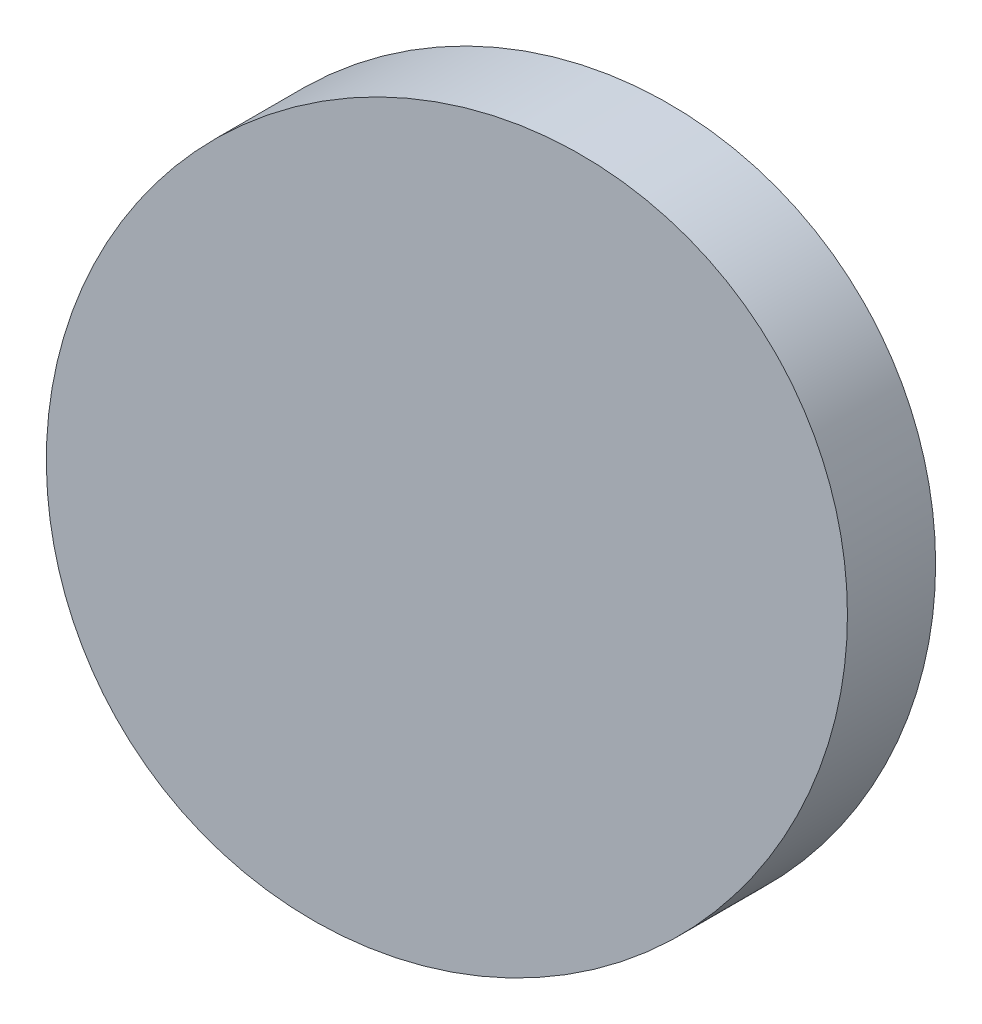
from build123d import *

# Parameters (mm, degrees)
SKETCH1_RX          = 52.344503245
SKETCH1_RY          = 36.976647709
BOSS_EXTRUDE1_DEPTH = 10


with BuildPart() as part:
    # Sketch1 → Boss-Extrude1 (new body)
    with BuildSketch(Plane.XY):
        with Locations(Location((-12.174885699, -6.140275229), (0, 0, 44.565949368))):
            Ellipse(SKETCH1_RX, SKETCH1_RY)
    extrude(amount=BOSS_EXTRUDE1_DEPTH)


solid = part.part
